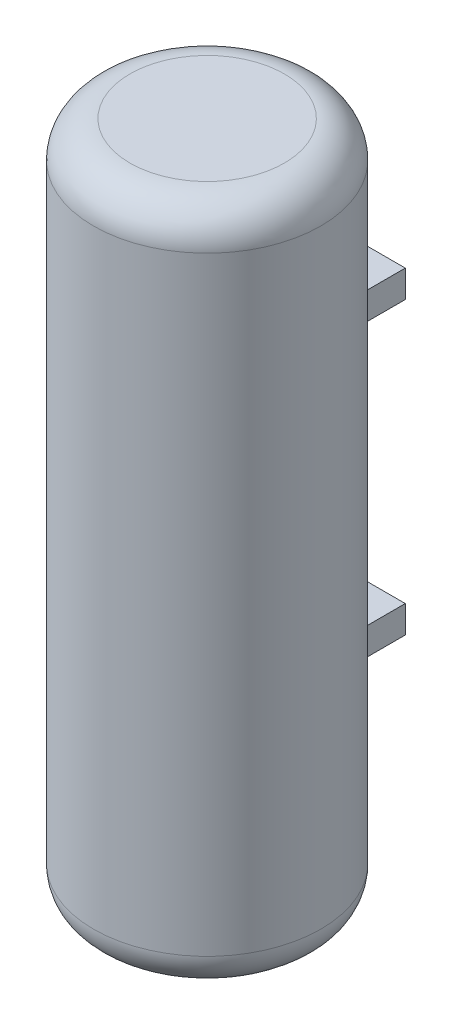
from build123d import *

# Parameters (mm, degrees)
ESQUISSE1_R        = 250
BOSS_EXTRU_1_DEPTH = 1500
CONG_1_R           = 80
ESQUISSE2_R        = 75
BOSS_EXTRU_2_DEPTH = 60
CHANFREIN1_SIZE    = 20
ESQUISSE3_W        = 300
ESQUISSE3_H        = 60
BOSS_EXTRU_3_DEPTH = 286


with BuildPart() as part:
    # Esquisse1 → Boss.-Extru.1 (new body)
    with BuildSketch(Plane(origin=(0, 0, 0), x_dir=(1, 0, 0), z_dir=(0, 1, 0))):
        with Locations(Location((0, 0, 0), (0, 0, 270))):
            Circle(ESQUISSE1_R)
    extrude(amount=BOSS_EXTRU_1_DEPTH)

    # Cong_1
    cong_1_edges = [part.edges().sort_by_distance(p)[0] for p in [
        (0, 0, -250),
        (0, 1500, -250),
    ]]
    fillet(cong_1_edges, radius=CONG_1_R)

    # Esquisse2 → Boss.-Extru.2 (add)
    with BuildSketch(Plane.XZ):
        with Locations(Location((0, 0, 0), (0, 0, 90))):
            Circle(ESQUISSE2_R)
    extrude(amount=BOSS_EXTRU_2_DEPTH)

    # Chanfrein1
    chanfrein1_edges = [part.edges().sort_by_distance(p)[0] for p in [
        (0, -60, -75),
    ]]
    chamfer(chanfrein1_edges, length=CHANFREIN1_SIZE)

    # Esquisse3 → Boss.-Extru.3 (add)
    with BuildSketch(Plane.XY):
        with Locations((0, 1116.937076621)):
            Rectangle(ESQUISSE3_W, ESQUISSE3_H)
        with Locations((0, 477.631468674)):
            Rectangle(ESQUISSE3_W, ESQUISSE3_H)
    extrude(amount=-BOSS_EXTRU_3_DEPTH)


solid = part.part
